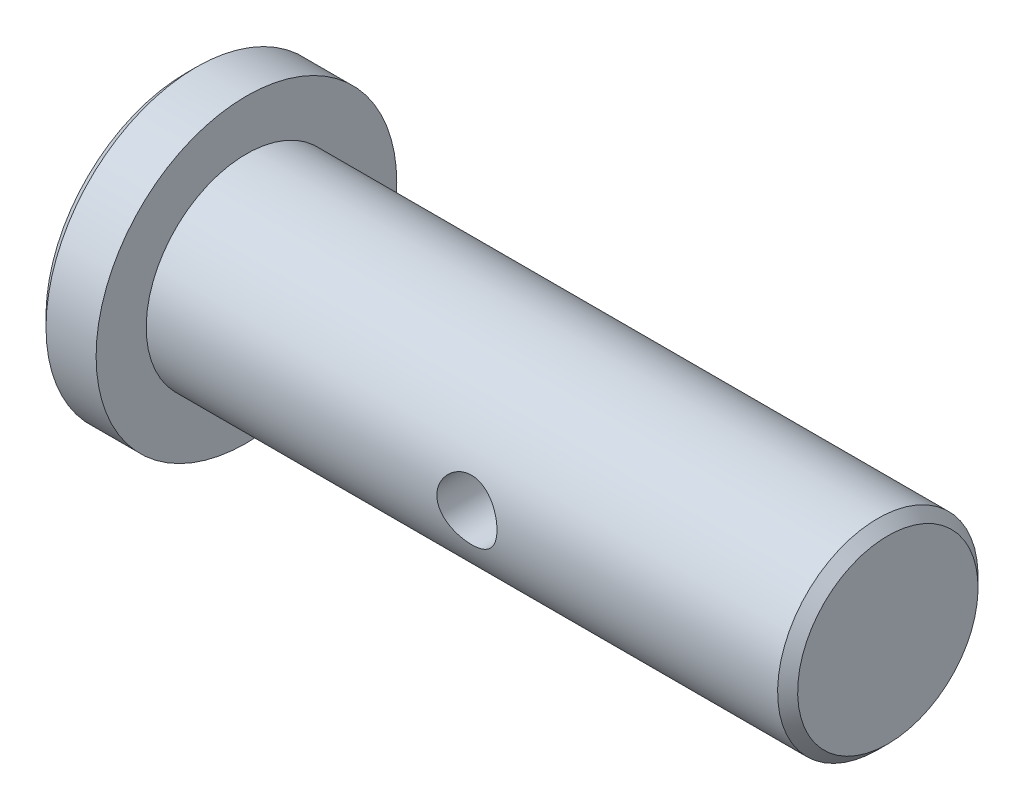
ISO-10303-21;
HEADER;
FILE_DESCRIPTION(('STEP AP214'),'2;1');
FILE_NAME('part.step','',(''),(''),'','','');
FILE_SCHEMA(('AUTOMOTIVE_DESIGN { 1 0 10303 214 1 1 1 1 }'));
ENDSEC;
DATA;
#1=APPLICATION_CONTEXT('core data for automotive mechanical design processes');
#2=APPLICATION_PROTOCOL_DEFINITION('international standard','automotive_design',2000,#1);
#3=PRODUCT_CONTEXT('',#1,'mechanical');
#4=PRODUCT('Part','Part','',(#3));
#5=PRODUCT_RELATED_PRODUCT_CATEGORY('part','',(#4));
#6=PRODUCT_DEFINITION_FORMATION('','',#4);
#7=PRODUCT_DEFINITION_CONTEXT('part definition',#1,'design');
#8=PRODUCT_DEFINITION('design','',#6,#7);
#9=PRODUCT_DEFINITION_SHAPE('','',#8);
#10=(LENGTH_UNIT() NAMED_UNIT(*) SI_UNIT(.MILLI.,.METRE.));
#11=(NAMED_UNIT(*) PLANE_ANGLE_UNIT() SI_UNIT($,.RADIAN.));
#12=(NAMED_UNIT(*) SI_UNIT($,.STERADIAN.) SOLID_ANGLE_UNIT());
#13=UNCERTAINTY_MEASURE_WITH_UNIT(LENGTH_MEASURE(1.E-05),#10,'distance_accuracy_value','');
#14=(GEOMETRIC_REPRESENTATION_CONTEXT(3) GLOBAL_UNCERTAINTY_ASSIGNED_CONTEXT((#13)) GLOBAL_UNIT_ASSIGNED_CONTEXT((#10,
#11,#12)) REPRESENTATION_CONTEXT('',''));
#15=CARTESIAN_POINT('',(0.,0.,0.));
#16=DIRECTION('',(0.,0.,1.));
#17=DIRECTION('',(1.,0.,0.));
#18=AXIS2_PLACEMENT_3D('',#15,#16,#17);
#19=CARTESIAN_POINT('',(0.,0.,0.));
#20=DIRECTION('',(1.,0.,0.));
#21=DIRECTION('',(0.,1.,0.));
#22=AXIS2_PLACEMENT_3D('',#19,#20,#21);
#23=PLANE('',#22);
#24=CARTESIAN_POINT('',(0.,0.,0.));
#25=DIRECTION('',(1.,0.,0.));
#26=DIRECTION('',(0.,1.,0.));
#27=AXIS2_PLACEMENT_3D('',#24,#25,#26);
#28=CIRCLE('',#27,14.);
#29=CARTESIAN_POINT('',(0.,14.,0.));
#30=VERTEX_POINT('',#29);
#31=EDGE_CURVE('E48',#30,#30,#28,.F.);
#32=ORIENTED_EDGE('',*,*,#31,.T.);
#33=EDGE_LOOP('',(#32));
#34=FACE_BOUND('',#33,.T.);
#35=ADVANCED_FACE('F30',(#34),#23,.F.);
#36=CARTESIAN_POINT('',(0.,0.,0.));
#37=DIRECTION('',(-1.,0.,0.));
#38=DIRECTION('',(0.,-1.,0.));
#39=AXIS2_PLACEMENT_3D('',#36,#37,#38);
#40=CYLINDRICAL_SURFACE('',#39,15.);
#41=CARTESIAN_POINT('',(0.999999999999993,0.,0.));
#42=DIRECTION('',(1.,0.,0.));
#43=DIRECTION('',(0.,1.,0.));
#44=AXIS2_PLACEMENT_3D('',#41,#42,#43);
#45=CIRCLE('',#44,15.);
#46=CARTESIAN_POINT('',(0.999999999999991,15.,0.));
#47=VERTEX_POINT('',#46);
#48=EDGE_CURVE('E44',#47,#47,#45,.T.);
#49=ORIENTED_EDGE('',*,*,#48,.T.);
#50=EDGE_LOOP('',(#49));
#51=FACE_BOUND('',#50,.T.);
#52=CARTESIAN_POINT('',(6.,0.,0.));
#53=DIRECTION('',(-1.,0.,0.));
#54=DIRECTION('',(0.,-1.,0.));
#55=AXIS2_PLACEMENT_3D('',#52,#53,#54);
#56=CIRCLE('',#55,15.);
#57=CARTESIAN_POINT('',(6.,-15.,0.));
#58=VERTEX_POINT('',#57);
#59=EDGE_CURVE('E94',#58,#58,#56,.T.);
#60=ORIENTED_EDGE('',*,*,#59,.T.);
#61=EDGE_LOOP('',(#60));
#62=FACE_BOUND('',#61,.T.);
#63=ADVANCED_FACE('F79',(#51,#62),#40,.T.);
#64=CARTESIAN_POINT('',(6.,15.,0.));
#65=DIRECTION('',(-1.,0.,0.));
#66=DIRECTION('',(0.,-1.,0.));
#67=AXIS2_PLACEMENT_3D('',#64,#65,#66);
#68=PLANE('',#67);
#69=ORIENTED_EDGE('',*,*,#59,.F.);
#70=EDGE_LOOP('',(#69));
#71=FACE_BOUND('',#70,.T.);
#72=CARTESIAN_POINT('',(6.,0.,0.));
#73=DIRECTION('',(-1.,0.,0.));
#74=DIRECTION('',(0.,-1.,0.));
#75=AXIS2_PLACEMENT_3D('',#72,#73,#74);
#76=CIRCLE('',#75,10.);
#77=CARTESIAN_POINT('',(6.,-10.,0.));
#78=VERTEX_POINT('',#77);
#79=EDGE_CURVE('E97',#78,#78,#76,.T.);
#80=ORIENTED_EDGE('',*,*,#79,.T.);
#81=EDGE_LOOP('',(#80));
#82=FACE_BOUND('',#81,.T.);
#83=ADVANCED_FACE('F76',(#71,#82),#68,.F.);
#84=CARTESIAN_POINT('',(0.,0.,0.));
#85=DIRECTION('',(-1.,0.,0.));
#86=DIRECTION('',(0.,-1.,0.));
#87=AXIS2_PLACEMENT_3D('',#84,#85,#86);
#88=CYLINDRICAL_SURFACE('',#87,9.99999999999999);
#89=CARTESIAN_POINT('',(41.,0.,-9.99999999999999));
#90=CARTESIAN_POINT('',(40.9999980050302,0.1645772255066,-9.999998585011));
#91=CARTESIAN_POINT('',(40.9864122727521,0.329174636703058,-9.99589831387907));
#92=CARTESIAN_POINT('',(40.9325572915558,0.653576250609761,-9.97994211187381));
#93=CARTESIAN_POINT('',(40.8922800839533,0.813379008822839,-9.96808386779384));
#94=CARTESIAN_POINT('',(40.7865079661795,1.12346541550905,-9.93791105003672));
#95=CARTESIAN_POINT('',(40.7210502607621,1.27376272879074,-9.9196060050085));
#96=CARTESIAN_POINT('',(40.5669278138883,1.56124836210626,-9.8784421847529));
#97=CARTESIAN_POINT('',(40.4782599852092,1.69843493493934,-9.85558280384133));
#98=CARTESIAN_POINT('',(40.2775519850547,1.95974359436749,-9.80701474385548));
#99=CARTESIAN_POINT('',(40.1649667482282,2.08343614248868,-9.78124767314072));
#100=CARTESIAN_POINT('',(39.9207815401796,2.31049841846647,-9.73011668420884));
#101=CARTESIAN_POINT('',(39.7891783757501,2.41386472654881,-9.70475283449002));
#102=CARTESIAN_POINT('',(39.5070584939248,2.59960075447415,-9.65668227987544));
#103=CARTESIAN_POINT('',(39.3561830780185,2.68144618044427,-9.63404813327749));
#104=CARTESIAN_POINT('',(39.0420214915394,2.81842789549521,-9.59487240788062));
#105=CARTESIAN_POINT('',(38.8787383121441,2.87357059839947,-9.57832936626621));
#106=CARTESIAN_POINT('',(38.5492194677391,2.95403267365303,-9.55381741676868));
#107=CARTESIAN_POINT('',(38.3831945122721,2.98014392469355,-9.54562138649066));
#108=CARTESIAN_POINT('',(38.0489336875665,3.00427461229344,-9.53805579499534));
#109=CARTESIAN_POINT('',(37.8806983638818,3.00230085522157,-9.53868409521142));
#110=CARTESIAN_POINT('',(37.553232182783,2.97093954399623,-9.54849488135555));
#111=CARTESIAN_POINT('',(37.3938954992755,2.94254410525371,-9.55736777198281));
#112=CARTESIAN_POINT('',(37.0823604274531,2.86074840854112,-9.58216712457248));
#113=CARTESIAN_POINT('',(36.9301627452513,2.80734568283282,-9.59809428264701));
#114=CARTESIAN_POINT('',(36.6347993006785,2.67632053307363,-9.63545466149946));
#115=CARTESIAN_POINT('',(36.4917858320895,2.59837633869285,-9.65696032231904));
#116=CARTESIAN_POINT('',(36.2205359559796,2.42070445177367,-9.70301974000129));
#117=CARTESIAN_POINT('',(36.0923031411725,2.32097148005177,-9.72757423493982));
#118=CARTESIAN_POINT('',(35.848627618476,2.09762581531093,-9.77822022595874));
#119=CARTESIAN_POINT('',(35.7339426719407,1.97318981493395,-9.80433308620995));
#120=CARTESIAN_POINT('',(35.5268920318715,1.70652651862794,-9.85424488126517));
#121=CARTESIAN_POINT('',(35.4345277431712,1.56429810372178,-9.87804367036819));
#122=CARTESIAN_POINT('',(35.2742801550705,1.26471007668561,-9.9208632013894));
#123=CARTESIAN_POINT('',(35.2065649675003,1.1072554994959,-9.93985087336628));
#124=CARTESIAN_POINT('',(35.0988008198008,0.78249083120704,-9.97067043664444));
#125=CARTESIAN_POINT('',(35.058744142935,0.615183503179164,-9.98250432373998));
#126=CARTESIAN_POINT('',(35.0086956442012,0.281904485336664,-9.99736729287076));
#127=CARTESIAN_POINT('',(34.9976768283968,0.116100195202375,-10.0006970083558));
#128=CARTESIAN_POINT('',(35.0031383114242,-0.214999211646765,-9.99905846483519));
#129=CARTESIAN_POINT('',(35.0196149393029,-0.38029439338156,-9.99409131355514));
#130=CARTESIAN_POINT('',(35.078769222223,-0.701807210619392,-9.97661393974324));
#131=CARTESIAN_POINT('',(35.1208467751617,-0.858145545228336,-9.96427659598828));
#132=CARTESIAN_POINT('',(35.2292864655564,-1.16150927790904,-9.93348695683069));
#133=CARTESIAN_POINT('',(35.2956515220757,-1.30853355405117,-9.91503392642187));
#134=CARTESIAN_POINT('',(35.4525063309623,-1.5928743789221,-9.8733930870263));
#135=CARTESIAN_POINT('',(35.543518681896,-1.72988765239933,-9.8501056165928));
#136=CARTESIAN_POINT('',(35.7464495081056,-1.9870466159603,-9.80146937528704));
#137=CARTESIAN_POINT('',(35.8583732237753,-2.10718806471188,-9.77612008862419));
#138=CARTESIAN_POINT('',(36.1047746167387,-2.33171489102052,-9.72506343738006));
#139=CARTESIAN_POINT('',(36.2399237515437,-2.43536962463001,-9.69937650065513));
#140=CARTESIAN_POINT('',(36.5262558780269,-2.61857990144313,-9.65153030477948));
#141=CARTESIAN_POINT('',(36.6774384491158,-2.69813607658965,-9.6293709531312));
#142=CARTESIAN_POINT('',(36.99106498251,-2.83034694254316,-9.59134379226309));
#143=CARTESIAN_POINT('',(37.1534523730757,-2.88312693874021,-9.575446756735));
#144=CARTESIAN_POINT('',(37.4853759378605,-2.96043461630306,-9.55183188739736));
#145=CARTESIAN_POINT('',(37.6549096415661,-2.98497197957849,-9.54411125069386));
#146=CARTESIAN_POINT('',(37.9887230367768,-3.0044396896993,-9.53799944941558));
#147=CARTESIAN_POINT('',(38.1529273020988,-3.00056110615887,-9.53923294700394));
#148=CARTESIAN_POINT('',(38.4782282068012,-2.9661501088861,-9.54998802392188));
#149=CARTESIAN_POINT('',(38.639324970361,-2.93561876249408,-9.55950927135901));
#150=CARTESIAN_POINT('',(38.9518907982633,-2.84953777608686,-9.58551527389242));
#151=CARTESIAN_POINT('',(39.1034545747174,-2.79430351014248,-9.60191209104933));
#152=CARTESIAN_POINT('',(39.3952848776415,-2.66063014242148,-9.63980557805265));
#153=CARTESIAN_POINT('',(39.5355492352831,-2.58218659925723,-9.6613032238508));
#154=CARTESIAN_POINT('',(39.8063262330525,-2.40097527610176,-9.70795352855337));
#155=CARTESIAN_POINT('',(39.9362975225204,-2.29742552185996,-9.73321080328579));
#156=CARTESIAN_POINT('',(40.1774049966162,-2.07034869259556,-9.78402640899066));
#157=CARTESIAN_POINT('',(40.2885362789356,-1.94681643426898,-9.80958481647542));
#158=CARTESIAN_POINT('',(40.4920468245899,-1.67893152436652,-9.85901873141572));
#159=CARTESIAN_POINT('',(40.583782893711,-1.53407577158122,-9.88282319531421));
#160=CARTESIAN_POINT('',(40.7414703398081,-1.23028274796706,-9.92521360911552));
#161=CARTESIAN_POINT('',(40.807433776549,-1.07135210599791,-9.94380199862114));
#162=CARTESIAN_POINT('',(40.9057905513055,-0.761515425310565,-9.97204349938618));
#163=CARTESIAN_POINT('',(40.9410233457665,-0.611573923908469,-9.98244054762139));
#164=CARTESIAN_POINT('',(40.9881270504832,-0.307760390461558,-9.9964188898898));
#165=CARTESIAN_POINT('',(41.0000018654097,-0.153889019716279,-10.0000013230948));
#166=CARTESIAN_POINT('',(41.,0.,-9.99999999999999));
#167=B_SPLINE_CURVE_WITH_KNOTS('',3,(#89,#90,#91,#92,#93,#94,#95,#96,#97,#98,#99,#100,#101,#102,
#103,#104,#105,#106,#107,#108,#109,#110,#111,#112,#113,#114,#115,#116,#117,#118,#119,#120,#121,
#122,#123,#124,#125,#126,#127,#128,#129,#130,#131,#132,#133,#134,#135,#136,#137,#138,#139,#140,
#141,#142,#143,#144,#145,#146,#147,#148,#149,#150,#151,#152,#153,#154,#155,#156,#157,#158,#159,
#160,#161,#162,#163,#164,#165,#166),.UNSPECIFIED.,.T.,.F.,(4,2,2,2,2,2,2,2,2,2,2,2,2,2,2,2,2,2,
2,2,2,2,2,2,2,2,2,2,2,2,2,2,2,2,2,2,2,2,4),(0.,0.49316640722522,0.986479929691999,
1.47906735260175,1.9717203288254,2.47711205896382,2.98258874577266,3.49942962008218,
4.01614629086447,4.51839378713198,5.02051956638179,5.50452033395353,5.98856887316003,
6.4792485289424,6.97004720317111,7.48134208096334,7.99266913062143,8.50742093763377,
9.02202907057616,9.5181761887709,10.0142570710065,10.4991349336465,10.9840710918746,
11.4802261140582,11.9765056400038,12.4908080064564,13.0050968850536,13.516956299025,
14.0286401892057,14.5190031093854,15.0093463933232,15.4936008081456,15.9779479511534,
16.4799385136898,16.9820594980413,17.4988599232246,18.0154182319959,18.4766338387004,
18.9377723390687),.UNSPECIFIED.);
#168=CARTESIAN_POINT('',(41.,0.,-9.99999999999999));
#169=VERTEX_POINT('',#168);
#170=EDGE_CURVE('E10',#169,#169,#167,.T.);
#171=ORIENTED_EDGE('',*,*,#170,.T.);
#172=EDGE_LOOP('',(#171));
#173=FACE_BOUND('',#172,.T.);
#174=CARTESIAN_POINT('',(41.,0.,10.));
#175=CARTESIAN_POINT('',(40.9999980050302,-0.164577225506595,9.99999858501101));
#176=CARTESIAN_POINT('',(40.9864122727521,-0.329174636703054,9.99589831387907));
#177=CARTESIAN_POINT('',(40.9325572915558,-0.653576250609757,9.97994211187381));
#178=CARTESIAN_POINT('',(40.8922800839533,-0.813379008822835,9.96808386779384));
#179=CARTESIAN_POINT('',(40.7865079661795,-1.12346541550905,9.93791105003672));
#180=CARTESIAN_POINT('',(40.7210502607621,-1.27376272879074,9.9196060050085));
#181=CARTESIAN_POINT('',(40.5669278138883,-1.56124836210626,9.8784421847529));
#182=CARTESIAN_POINT('',(40.4782599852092,-1.69843493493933,9.85558280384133));
#183=CARTESIAN_POINT('',(40.2775519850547,-1.95974359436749,9.80701474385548));
#184=CARTESIAN_POINT('',(40.1649667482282,-2.08343614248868,9.78124767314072));
#185=CARTESIAN_POINT('',(39.9207815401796,-2.31049841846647,9.73011668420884));
#186=CARTESIAN_POINT('',(39.7891783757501,-2.41386472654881,9.70475283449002));
#187=CARTESIAN_POINT('',(39.5070584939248,-2.59960075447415,9.65668227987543));
#188=CARTESIAN_POINT('',(39.3561830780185,-2.68144618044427,9.63404813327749));
#189=CARTESIAN_POINT('',(39.0420214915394,-2.81842789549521,9.59487240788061));
#190=CARTESIAN_POINT('',(38.8787383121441,-2.87357059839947,9.57832936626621));
#191=CARTESIAN_POINT('',(38.5492194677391,-2.95403267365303,9.55381741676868));
#192=CARTESIAN_POINT('',(38.3831945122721,-2.98014392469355,9.54562138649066));
#193=CARTESIAN_POINT('',(38.0489336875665,-3.00427461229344,9.53805579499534));
#194=CARTESIAN_POINT('',(37.8806983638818,-3.00230085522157,9.53868409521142));
#195=CARTESIAN_POINT('',(37.553232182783,-2.97093954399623,9.54849488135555));
#196=CARTESIAN_POINT('',(37.3938954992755,-2.94254410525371,9.5573677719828));
#197=CARTESIAN_POINT('',(37.0823604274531,-2.86074840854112,9.58216712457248));
#198=CARTESIAN_POINT('',(36.9301627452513,-2.80734568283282,9.598094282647));
#199=CARTESIAN_POINT('',(36.6347993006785,-2.67632053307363,9.63545466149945));
#200=CARTESIAN_POINT('',(36.4917858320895,-2.59837633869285,9.65696032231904));
#201=CARTESIAN_POINT('',(36.2205359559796,-2.42070445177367,9.70301974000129));
#202=CARTESIAN_POINT('',(36.0923031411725,-2.32097148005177,9.72757423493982));
#203=CARTESIAN_POINT('',(35.848627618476,-2.09762581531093,9.77822022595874));
#204=CARTESIAN_POINT('',(35.7339426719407,-1.97318981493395,9.80433308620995));
#205=CARTESIAN_POINT('',(35.5268920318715,-1.70652651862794,9.85424488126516));
#206=CARTESIAN_POINT('',(35.4345277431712,-1.56429810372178,9.87804367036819));
#207=CARTESIAN_POINT('',(35.2742801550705,-1.26471007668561,9.9208632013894));
#208=CARTESIAN_POINT('',(35.2065649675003,-1.10725549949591,9.93985087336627));
#209=CARTESIAN_POINT('',(35.0988008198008,-0.782490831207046,9.97067043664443));
#210=CARTESIAN_POINT('',(35.058744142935,-0.61518350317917,9.98250432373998));
#211=CARTESIAN_POINT('',(35.0086956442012,-0.281904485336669,9.99736729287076));
#212=CARTESIAN_POINT('',(34.9976768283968,-0.11610019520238,10.0006970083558));
#213=CARTESIAN_POINT('',(35.0031383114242,0.21499921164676,9.99905846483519));
#214=CARTESIAN_POINT('',(35.0196149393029,0.380294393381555,9.99409131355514));
#215=CARTESIAN_POINT('',(35.078769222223,0.701807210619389,9.97661393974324));
#216=CARTESIAN_POINT('',(35.1208467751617,0.858145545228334,9.96427659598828));
#217=CARTESIAN_POINT('',(35.2292864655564,1.16150927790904,9.93348695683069));
#218=CARTESIAN_POINT('',(35.2956515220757,1.30853355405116,9.91503392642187));
#219=CARTESIAN_POINT('',(35.4525063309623,1.5928743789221,9.8733930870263));
#220=CARTESIAN_POINT('',(35.543518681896,1.72988765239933,9.8501056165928));
#221=CARTESIAN_POINT('',(35.7464495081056,1.98704661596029,9.80146937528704));
#222=CARTESIAN_POINT('',(35.8583732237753,2.10718806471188,9.77612008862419));
#223=CARTESIAN_POINT('',(36.1047746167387,2.33171489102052,9.72506343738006));
#224=CARTESIAN_POINT('',(36.2399237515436,2.43536962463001,9.69937650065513));
#225=CARTESIAN_POINT('',(36.5262558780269,2.61857990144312,9.65153030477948));
#226=CARTESIAN_POINT('',(36.6774384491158,2.69813607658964,9.62937095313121));
#227=CARTESIAN_POINT('',(36.99106498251,2.83034694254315,9.59134379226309));
#228=CARTESIAN_POINT('',(37.1534523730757,2.88312693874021,9.575446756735));
#229=CARTESIAN_POINT('',(37.4853759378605,2.96043461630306,9.55183188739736));
#230=CARTESIAN_POINT('',(37.6549096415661,2.98497197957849,9.54411125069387));
#231=CARTESIAN_POINT('',(37.9887230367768,3.0044396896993,9.53799944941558));
#232=CARTESIAN_POINT('',(38.1529273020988,3.00056110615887,9.53923294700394));
#233=CARTESIAN_POINT('',(38.4782282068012,2.9661501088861,9.54998802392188));
#234=CARTESIAN_POINT('',(38.639324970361,2.93561876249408,9.55950927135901));
#235=CARTESIAN_POINT('',(38.9518907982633,2.84953777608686,9.58551527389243));
#236=CARTESIAN_POINT('',(39.1034545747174,2.79430351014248,9.60191209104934));
#237=CARTESIAN_POINT('',(39.3952848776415,2.66063014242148,9.63980557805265));
#238=CARTESIAN_POINT('',(39.5355492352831,2.58218659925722,9.6613032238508));
#239=CARTESIAN_POINT('',(39.8063262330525,2.40097527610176,9.70795352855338));
#240=CARTESIAN_POINT('',(39.9362975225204,2.29742552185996,9.7332108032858));
#241=CARTESIAN_POINT('',(40.1774049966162,2.07034869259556,9.78402640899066));
#242=CARTESIAN_POINT('',(40.2885362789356,1.94681643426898,9.80958481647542));
#243=CARTESIAN_POINT('',(40.4920468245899,1.67893152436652,9.85901873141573));
#244=CARTESIAN_POINT('',(40.583782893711,1.53407577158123,9.88282319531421));
#245=CARTESIAN_POINT('',(40.7414703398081,1.23028274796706,9.92521360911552));
#246=CARTESIAN_POINT('',(40.807433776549,1.07135210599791,9.94380199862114));
#247=CARTESIAN_POINT('',(40.9057905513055,0.761515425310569,9.97204349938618));
#248=CARTESIAN_POINT('',(40.9410233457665,0.611573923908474,9.98244054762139));
#249=CARTESIAN_POINT('',(40.9881270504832,0.307760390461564,9.9964188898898));
#250=CARTESIAN_POINT('',(41.0000018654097,0.153889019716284,10.0000013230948));
#251=CARTESIAN_POINT('',(41.,0.,10.));
#252=B_SPLINE_CURVE_WITH_KNOTS('',3,(#174,#175,#176,#177,#178,#179,#180,#181,#182,#183,#184,
#185,#186,#187,#188,#189,#190,#191,#192,#193,#194,#195,#196,#197,#198,#199,#200,#201,#202,#203,
#204,#205,#206,#207,#208,#209,#210,#211,#212,#213,#214,#215,#216,#217,#218,#219,#220,#221,#222,
#223,#224,#225,#226,#227,#228,#229,#230,#231,#232,#233,#234,#235,#236,#237,#238,#239,#240,#241,
#242,#243,#244,#245,#246,#247,#248,#249,#250,#251),.UNSPECIFIED.,.T.,.F.,(4,2,2,2,2,2,2,2,2,2,2,
2,2,2,2,2,2,2,2,2,2,2,2,2,2,2,2,2,2,2,2,2,2,2,2,2,2,2,4),(0.,0.493166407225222,0.986479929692,
1.47906735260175,1.97172032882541,2.47711205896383,2.98258874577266,3.49942962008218,
4.01614629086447,4.51839378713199,5.0205195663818,5.50452033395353,5.98856887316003,
6.4792485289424,6.97004720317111,7.48134208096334,7.99266913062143,8.50742093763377,
9.02202907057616,9.5181761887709,10.0142570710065,10.4991349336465,10.9840710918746,
11.4802261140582,11.9765056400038,12.4908080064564,13.0050968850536,13.516956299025,
14.0286401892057,14.5190031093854,15.0093463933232,15.4936008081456,15.9779479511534,
16.4799385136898,16.9820594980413,17.4988599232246,18.0154182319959,18.4766338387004,
18.9377723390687),.UNSPECIFIED.);
#253=CARTESIAN_POINT('',(41.,0.,10.));
#254=VERTEX_POINT('',#253);
#255=EDGE_CURVE('E40',#254,#254,#252,.T.);
#256=ORIENTED_EDGE('',*,*,#255,.T.);
#257=EDGE_LOOP('',(#256));
#258=FACE_BOUND('',#257,.T.);
#259=CARTESIAN_POINT('',(69.,0.,0.));
#260=DIRECTION('',(-1.,0.,0.));
#261=DIRECTION('',(0.,-1.,0.));
#262=AXIS2_PLACEMENT_3D('',#259,#260,#261);
#263=CIRCLE('',#262,9.99999999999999);
#264=CARTESIAN_POINT('',(69.,-9.99999999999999,0.));
#265=VERTEX_POINT('',#264);
#266=EDGE_CURVE('E89',#265,#265,#263,.T.);
#267=ORIENTED_EDGE('',*,*,#266,.T.);
#268=EDGE_LOOP('',(#267));
#269=FACE_BOUND('',#268,.T.);
#270=ORIENTED_EDGE('',*,*,#79,.F.);
#271=EDGE_LOOP('',(#270));
#272=FACE_BOUND('',#271,.T.);
#273=ADVANCED_FACE('F53',(#173,#258,#269,#272),#88,.T.);
#274=CARTESIAN_POINT('',(70.,10.,0.));
#275=DIRECTION('',(-1.,0.,0.));
#276=DIRECTION('',(0.,-1.,0.));
#277=AXIS2_PLACEMENT_3D('',#274,#275,#276);
#278=PLANE('',#277);
#279=CARTESIAN_POINT('',(70.,0.,0.));
#280=DIRECTION('',(-1.,0.,0.));
#281=DIRECTION('',(0.,-1.,0.));
#282=AXIS2_PLACEMENT_3D('',#279,#280,#281);
#283=CIRCLE('',#282,9.00000000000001);
#284=CARTESIAN_POINT('',(70.,-9.,0.));
#285=VERTEX_POINT('',#284);
#286=EDGE_CURVE('E88',#285,#285,#283,.F.);
#287=ORIENTED_EDGE('',*,*,#286,.T.);
#288=EDGE_LOOP('',(#287));
#289=FACE_BOUND('',#288,.T.);
#290=ADVANCED_FACE('F69',(#289),#278,.F.);
#291=CARTESIAN_POINT('',(69.,0.,0.));
#292=DIRECTION('',(-1.,0.,0.));
#293=DIRECTION('',(0.,-1.,0.));
#294=AXIS2_PLACEMENT_3D('',#291,#292,#293);
#295=CONICAL_SURFACE('',#294,9.99999999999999,0.785398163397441);
#296=ORIENTED_EDGE('',*,*,#286,.F.);
#297=EDGE_LOOP('',(#296));
#298=FACE_BOUND('',#297,.T.);
#299=ORIENTED_EDGE('',*,*,#266,.F.);
#300=EDGE_LOOP('',(#299));
#301=FACE_BOUND('',#300,.T.);
#302=ADVANCED_FACE('F66',(#298,#301),#295,.T.);
#303=CARTESIAN_POINT('',(0.,0.,0.));
#304=DIRECTION('',(1.,0.,0.));
#305=DIRECTION('',(0.,1.,0.));
#306=AXIS2_PLACEMENT_3D('',#303,#304,#305);
#307=CONICAL_SURFACE('',#306,14.,0.785398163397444);
#308=ORIENTED_EDGE('',*,*,#48,.F.);
#309=EDGE_LOOP('',(#308));
#310=FACE_BOUND('',#309,.T.);
#311=ORIENTED_EDGE('',*,*,#31,.F.);
#312=EDGE_LOOP('',(#311));
#313=FACE_BOUND('',#312,.T.);
#314=ADVANCED_FACE('F61',(#310,#313),#307,.T.);
#315=CARTESIAN_POINT('',(38.,0.,-10.));
#316=DIRECTION('',(0.,0.,1.));
#317=DIRECTION('',(1.,0.,0.));
#318=AXIS2_PLACEMENT_3D('',#315,#316,#317);
#319=CYLINDRICAL_SURFACE('',#318,3.);
#320=ORIENTED_EDGE('',*,*,#255,.F.);
#321=EDGE_LOOP('',(#320));
#322=FACE_BOUND('',#321,.T.);
#323=ORIENTED_EDGE('',*,*,#170,.F.);
#324=EDGE_LOOP('',(#323));
#325=FACE_BOUND('',#324,.T.);
#326=ADVANCED_FACE('F57',(#322,#325),#319,.F.);
#327=CLOSED_SHELL('',(#35,#63,#83,#273,#290,#302,#314,#326));
#328=MANIFOLD_SOLID_BREP('B2',#327);
#329=ADVANCED_BREP_SHAPE_REPRESENTATION('',(#18,#328),#14);
#330=SHAPE_DEFINITION_REPRESENTATION(#9,#329);
ENDSEC;
END-ISO-10303-21;
